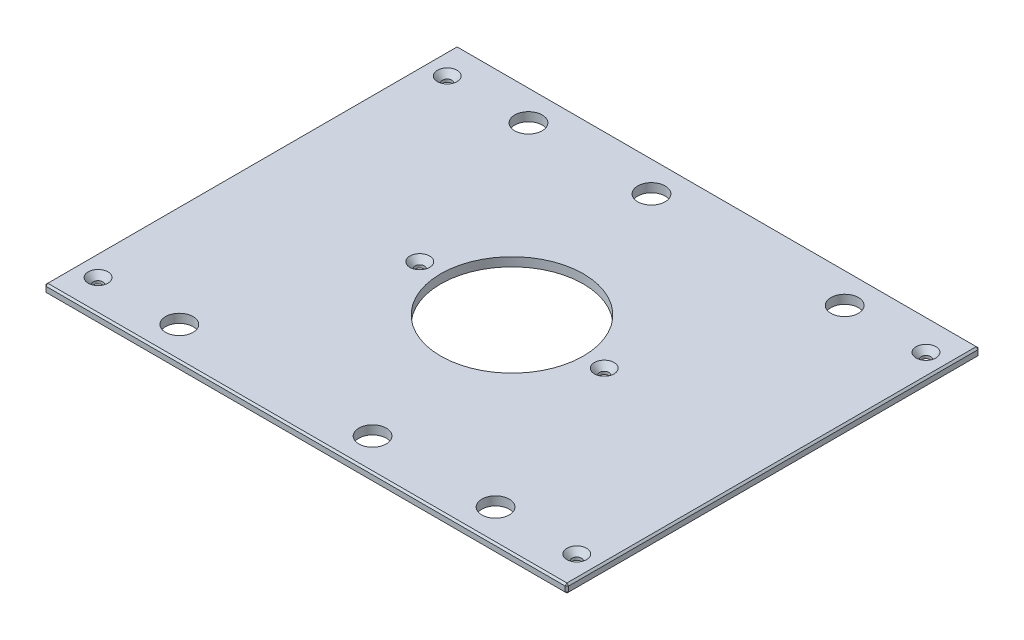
from build123d import *

# Parameters (mm, degrees)
SKETCH1_W                                     = 377.825
SKETCH1_H                                     = 298.45
BOSS_EXTRUDE1_DEPTH                           = 6.35
SKETCH13_R                                    = 51.562
CUT_EXTRUDE6_DEPTH                            = 241.82432556
F_25_32_0_78125_DIAMETER_HOLE1_D              = 19.84375
CHAMFER2_SIZE                                 = 1.27
CSK_FOR_1_4_FLAT_HEAD_MACHINE_SCREW1_AT_COUNT = 2
CSK_FOR_1_4_FLAT_HEAD_MACHINE_SCREW1_AT_PITCH = 252.40996
CSK_FOR_1_4_FLAT_HEAD_MACHINE_SCREW1_2_COUNT  = 2
CSK_FOR_1_4_FLAT_HEAD_MACHINE_SCREW1_2_PITCH  = 428.344129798
CSK_FOR_1_4_FLAT_HEAD_MACHINE_SCREW1_3_COUNT  = 2
CSK_FOR_1_4_FLAT_HEAD_MACHINE_SCREW1_3_PITCH  = 270.905480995
CSK_FOR_1_4_FLAT_HEAD_MACHINE_SCREW1_4_COUNT  = 2
CSK_FOR_1_4_FLAT_HEAD_MACHINE_SCREW1_4_PITCH  = 165.047503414
CSK_FOR_1_4_FLAT_HEAD_MACHINE_SCREW1_5_COUNT  = 2
CSK_FOR_1_4_FLAT_HEAD_MACHINE_SCREW1_5_PITCH  = 346.075
CSK_FOR_1_4_FLAT_HEAD_MACHINE_SCREW1_6_COUNT  = 2
CSK_FOR_1_4_FLAT_HEAD_MACHINE_SCREW1_6_PITCH  = 287.3375
CSK_FOR_1_4_FLAT_HEAD_MACHINE_SCREW1_7_COUNT  = 2
CSK_FOR_1_4_FLAT_HEAD_MACHINE_SCREW1_7_PITCH  = 382.457352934


with BuildPart() as part:
    # Sketch1 → Boss-Extrude1 (new body)
    with BuildSketch(Plane(origin=(0, 0, 0), x_dir=(1, 0, 0), z_dir=(0, 1, 0))):
        Rectangle(SKETCH1_W, SKETCH1_H)
    extrude(amount=BOSS_EXTRUDE1_DEPTH)

    # Sketch13 → Cut-Extrude6 (cut, through all)
    with BuildSketch(Plane(origin=(0, 6.35, 0), x_dir=(1, 0, 0), z_dir=(0, 1, 0))):
        with Locations(Location((0, 0, 0), (0, 0, 270))):
            Circle(SKETCH13_R)
    extrude(amount=-CUT_EXTRUDE6_DEPTH, mode=Mode.SUBTRACT)

    # 25_32 _0.78125_ Diameter Hole1 (through all)
    with Locations(Plane(origin=(0, 6.35, 0), x_dir=(1, 0, 0), z_dir=(0, 1, 0))):
        with Locations((114.3, 126.20498), (-114.3, 126.20498), (114.3, -126.20498), (-114.3, -126.20498), (-25.4, 126.20498), (25.4, -126.20498)):
            Hole(F_25_32_0_78125_DIAMETER_HOLE1_D / 2)

    # Chamfer2
    chamfer2_edges = [part.edges().sort_by_distance(p)[0] for p in [
        (188.9125, 6.35, 0),
        (0, 6.35, -149.225),
        (-188.9125, 6.35, 0),
        (0, 0, -149.225),
        (188.9125, 0, 0),
        (0, 0, 149.225),
        (-188.9125, 0, 0),
        (0, 6.35, 149.225),
        (-188.9125, 3.175, -149.225),
        (188.9125, 3.175, -149.225),
        (188.9125, 3.175, 149.225),
        (-188.9125, 3.175, 149.225),
    ]]
    chamfer(chamfer2_edges, length=CHAMFER2_SIZE)

    # Sketch24 → CSK for 1_4 Flat Head Machine Screw1 (revolve, cut)
    with BuildSketch(Plane(origin=(173.0375, 6.35, -126.20498), x_dir=(0, 0, 1), z_dir=(1, 0, 0))):
        Polygon((0, 0), (0, 6.35), (3.3782, 6.35), (3.3782, 4.324464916), (7.1374, 0), align=None)
    csk_for_1_4_flat_head_machine_screw1 = revolve(axis=Axis((173.0375, 12.7, -126.20498), (0, -1, 0)), mode=Mode.SUBTRACT)

    # CSK for 1_4 Flat Head Machine Screw1 at: CSK for 1_4 Flat Head Machine Screw1 ×2
    with Locations(*[(0, 0, i * CSK_FOR_1_4_FLAT_HEAD_MACHINE_SCREW1_AT_PITCH) for i in range(1, CSK_FOR_1_4_FLAT_HEAD_MACHINE_SCREW1_AT_COUNT)]):
        add(csk_for_1_4_flat_head_machine_screw1, mode=Mode.SUBTRACT)

    # CSK for 1_4 Flat Head Machine Screw1 2: CSK for 1_4 Flat Head Machine Screw1 ×2
    with Locations(*[Vector(-0.8079368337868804, 0, 0.5892691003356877) * (i * CSK_FOR_1_4_FLAT_HEAD_MACHINE_SCREW1_2_PITCH) for i in range(1, CSK_FOR_1_4_FLAT_HEAD_MACHINE_SCREW1_2_COUNT)]):
        add(csk_for_1_4_flat_head_machine_screw1, mode=Mode.SUBTRACT)

    # CSK for 1_4 Flat Head Machine Screw1 3: CSK for 1_4 Flat Head Machine Screw1 ×2
    with Locations(*[Vector(-0.8848565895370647, 0, 0.46586351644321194) * (i * CSK_FOR_1_4_FLAT_HEAD_MACHINE_SCREW1_3_PITCH) for i in range(1, CSK_FOR_1_4_FLAT_HEAD_MACHINE_SCREW1_3_COUNT)]):
        add(csk_for_1_4_flat_head_machine_screw1, mode=Mode.SUBTRACT)

    # CSK for 1_4 Flat Head Machine Screw1 4: CSK for 1_4 Flat Head Machine Screw1 ×2
    with Locations(*[Vector(-0.6444356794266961, 0, 0.7646585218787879) * (i * CSK_FOR_1_4_FLAT_HEAD_MACHINE_SCREW1_4_PITCH) for i in range(1, CSK_FOR_1_4_FLAT_HEAD_MACHINE_SCREW1_4_COUNT)]):
        add(csk_for_1_4_flat_head_machine_screw1, mode=Mode.SUBTRACT)

    # CSK for 1_4 Flat Head Machine Screw1 5: CSK for 1_4 Flat Head Machine Screw1 ×2
    with Locations(*[(-i * CSK_FOR_1_4_FLAT_HEAD_MACHINE_SCREW1_5_PITCH, 0, 0) for i in range(1, CSK_FOR_1_4_FLAT_HEAD_MACHINE_SCREW1_5_COUNT)]):
        add(csk_for_1_4_flat_head_machine_screw1, mode=Mode.SUBTRACT)

    # CSK for 1_4 Flat Head Machine Screw1 6: CSK for 1_4 Flat Head Machine Screw1 ×2
    with Locations(*[(-i * CSK_FOR_1_4_FLAT_HEAD_MACHINE_SCREW1_6_PITCH, 0, 0) for i in range(1, CSK_FOR_1_4_FLAT_HEAD_MACHINE_SCREW1_6_COUNT)]):
        add(csk_for_1_4_flat_head_machine_screw1, mode=Mode.SUBTRACT)

    # CSK for 1_4 Flat Head Machine Screw1 7: CSK for 1_4 Flat Head Machine Screw1 ×2
    with Locations(*[Vector(-0.7512929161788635, 0, 0.6599689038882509) * (i * CSK_FOR_1_4_FLAT_HEAD_MACHINE_SCREW1_7_PITCH) for i in range(1, CSK_FOR_1_4_FLAT_HEAD_MACHINE_SCREW1_7_COUNT)]):
        add(csk_for_1_4_flat_head_machine_screw1, mode=Mode.SUBTRACT)


solid = part.part
